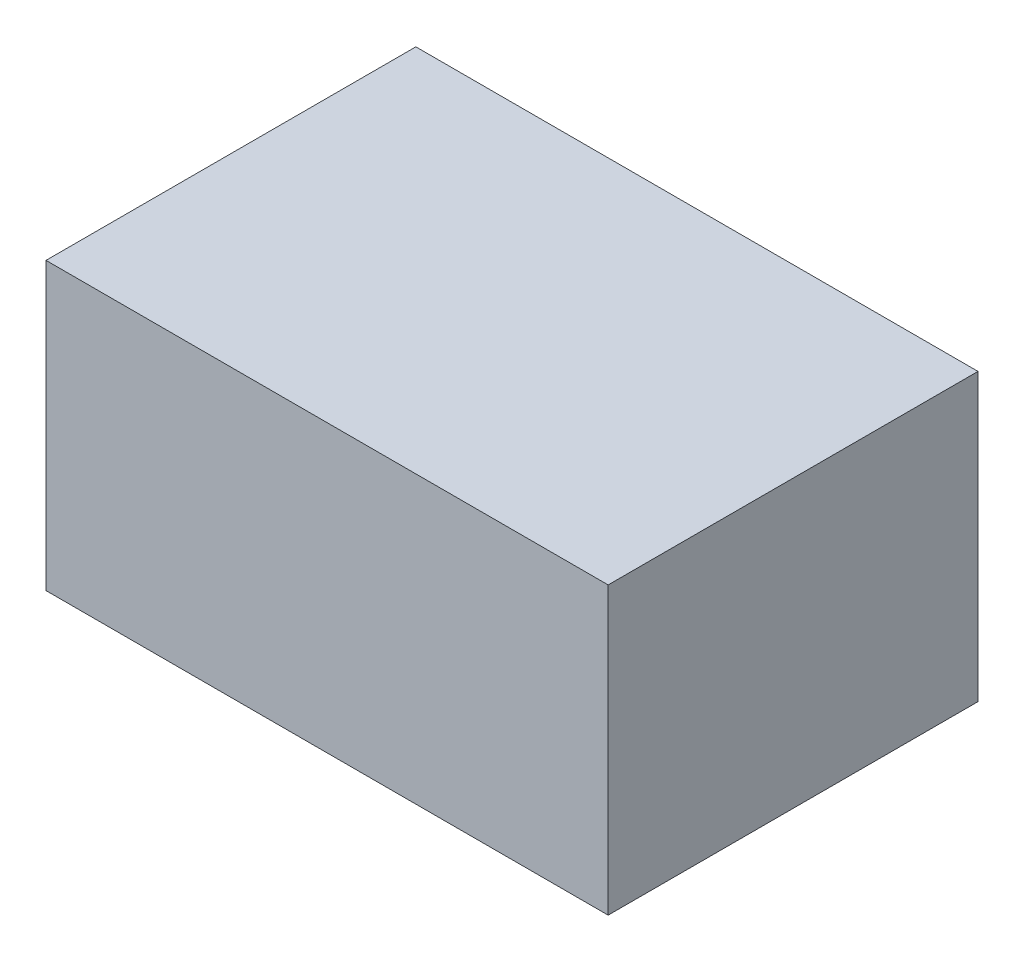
ISO-10303-21;
HEADER;
FILE_DESCRIPTION(('STEP AP214'),'2;1');
FILE_NAME('part.step','',(''),(''),'','','');
FILE_SCHEMA(('AUTOMOTIVE_DESIGN { 1 0 10303 214 1 1 1 1 }'));
ENDSEC;
DATA;
#1=APPLICATION_CONTEXT('core data for automotive mechanical design processes');
#2=APPLICATION_PROTOCOL_DEFINITION('international standard','automotive_design',2000,#1);
#3=PRODUCT_CONTEXT('',#1,'mechanical');
#4=PRODUCT('Part','Part','',(#3));
#5=PRODUCT_RELATED_PRODUCT_CATEGORY('part','',(#4));
#6=PRODUCT_DEFINITION_FORMATION('','',#4);
#7=PRODUCT_DEFINITION_CONTEXT('part definition',#1,'design');
#8=PRODUCT_DEFINITION('design','',#6,#7);
#9=PRODUCT_DEFINITION_SHAPE('','',#8);
#10=(LENGTH_UNIT() NAMED_UNIT(*) SI_UNIT(.MILLI.,.METRE.));
#11=(NAMED_UNIT(*) PLANE_ANGLE_UNIT() SI_UNIT($,.RADIAN.));
#12=(NAMED_UNIT(*) SI_UNIT($,.STERADIAN.) SOLID_ANGLE_UNIT());
#13=UNCERTAINTY_MEASURE_WITH_UNIT(LENGTH_MEASURE(1.E-05),#10,'distance_accuracy_value','');
#14=(GEOMETRIC_REPRESENTATION_CONTEXT(3) GLOBAL_UNCERTAINTY_ASSIGNED_CONTEXT((#13)) GLOBAL_UNIT_ASSIGNED_CONTEXT((#10,
#11,#12)) REPRESENTATION_CONTEXT('',''));
#15=CARTESIAN_POINT('',(0.,0.,0.));
#16=DIRECTION('',(0.,0.,1.));
#17=DIRECTION('',(1.,0.,0.));
#18=AXIS2_PLACEMENT_3D('',#15,#16,#17);
#19=CARTESIAN_POINT('',(0.,58.,0.));
#20=DIRECTION('',(1.,0.,0.));
#21=DIRECTION('',(0.,0.,-1.));
#22=AXIS2_PLACEMENT_3D('',#19,#20,#21);
#23=PLANE('',#22);
#24=DIRECTION('',(0.,0.,1.));
#25=VECTOR('',#24,1.);
#26=CARTESIAN_POINT('',(0.,0.,0.));
#27=LINE('',#26,#25);
#28=CARTESIAN_POINT('',(0.,0.,-75.));
#29=VERTEX_POINT('',#28);
#30=CARTESIAN_POINT('',(0.,0.,0.));
#31=VERTEX_POINT('',#30);
#32=EDGE_CURVE('E107',#29,#31,#27,.T.);
#33=ORIENTED_EDGE('',*,*,#32,.T.);
#34=DIRECTION('',(0.,-1.,0.));
#35=VECTOR('',#34,1.);
#36=CARTESIAN_POINT('',(0.,58.,0.));
#37=LINE('',#36,#35);
#38=CARTESIAN_POINT('',(0.,58.,0.));
#39=VERTEX_POINT('',#38);
#40=EDGE_CURVE('E11',#39,#31,#37,.T.);
#41=ORIENTED_EDGE('',*,*,#40,.F.);
#42=DIRECTION('',(0.,0.,1.));
#43=VECTOR('',#42,1.);
#44=CARTESIAN_POINT('',(0.,58.,0.));
#45=LINE('',#44,#43);
#46=CARTESIAN_POINT('',(0.,58.,-75.));
#47=VERTEX_POINT('',#46);
#48=EDGE_CURVE('E91',#47,#39,#45,.T.);
#49=ORIENTED_EDGE('',*,*,#48,.F.);
#50=DIRECTION('',(0.,-1.,0.));
#51=VECTOR('',#50,1.);
#52=CARTESIAN_POINT('',(0.,58.,-75.));
#53=LINE('',#52,#51);
#54=EDGE_CURVE('E103',#47,#29,#53,.T.);
#55=ORIENTED_EDGE('',*,*,#54,.T.);
#56=EDGE_LOOP('',(#33,#41,#49,#55));
#57=FACE_BOUND('',#56,.T.);
#58=ADVANCED_FACE('F39',(#57),#23,.F.);
#59=CARTESIAN_POINT('',(0.,58.,0.));
#60=DIRECTION('',(0.,0.,-1.));
#61=DIRECTION('',(-1.,0.,0.));
#62=AXIS2_PLACEMENT_3D('',#59,#60,#61);
#63=PLANE('',#62);
#64=DIRECTION('',(1.,0.,0.));
#65=VECTOR('',#64,1.);
#66=CARTESIAN_POINT('',(0.,0.,0.));
#67=LINE('',#66,#65);
#68=CARTESIAN_POINT('',(114.,0.,0.));
#69=VERTEX_POINT('',#68);
#70=EDGE_CURVE('E96',#31,#69,#67,.T.);
#71=ORIENTED_EDGE('',*,*,#70,.T.);
#72=DIRECTION('',(0.,-1.,0.));
#73=VECTOR('',#72,1.);
#74=CARTESIAN_POINT('',(114.,58.,0.));
#75=LINE('',#74,#73);
#76=CARTESIAN_POINT('',(114.,58.,0.));
#77=VERTEX_POINT('',#76);
#78=EDGE_CURVE('E48',#77,#69,#75,.T.);
#79=ORIENTED_EDGE('',*,*,#78,.F.);
#80=DIRECTION('',(1.,0.,0.));
#81=VECTOR('',#80,1.);
#82=CARTESIAN_POINT('',(0.,58.,0.));
#83=LINE('',#82,#81);
#84=EDGE_CURVE('E86',#39,#77,#83,.T.);
#85=ORIENTED_EDGE('',*,*,#84,.F.);
#86=ORIENTED_EDGE('',*,*,#40,.T.);
#87=EDGE_LOOP('',(#71,#79,#85,#86));
#88=FACE_BOUND('',#87,.T.);
#89=ADVANCED_FACE('F95',(#88),#63,.F.);
#90=CARTESIAN_POINT('',(114.,58.,0.));
#91=DIRECTION('',(-1.,0.,0.));
#92=DIRECTION('',(0.,0.,1.));
#93=AXIS2_PLACEMENT_3D('',#90,#91,#92);
#94=PLANE('',#93);
#95=DIRECTION('',(0.,0.,-1.));
#96=VECTOR('',#95,1.);
#97=CARTESIAN_POINT('',(114.,0.,0.));
#98=LINE('',#97,#96);
#99=CARTESIAN_POINT('',(114.,0.,-75.));
#100=VERTEX_POINT('',#99);
#101=EDGE_CURVE('E73',#69,#100,#98,.T.);
#102=ORIENTED_EDGE('',*,*,#101,.T.);
#103=DIRECTION('',(0.,-1.,0.));
#104=VECTOR('',#103,1.);
#105=CARTESIAN_POINT('',(114.,58.,-75.));
#106=LINE('',#105,#104);
#107=CARTESIAN_POINT('',(114.,58.,-75.));
#108=VERTEX_POINT('',#107);
#109=EDGE_CURVE('E98',#108,#100,#106,.T.);
#110=ORIENTED_EDGE('',*,*,#109,.F.);
#111=DIRECTION('',(0.,0.,-1.));
#112=VECTOR('',#111,1.);
#113=CARTESIAN_POINT('',(114.,58.,0.));
#114=LINE('',#113,#112);
#115=EDGE_CURVE('E89',#77,#108,#114,.T.);
#116=ORIENTED_EDGE('',*,*,#115,.F.);
#117=ORIENTED_EDGE('',*,*,#78,.T.);
#118=EDGE_LOOP('',(#102,#110,#116,#117));
#119=FACE_BOUND('',#118,.T.);
#120=ADVANCED_FACE('F99',(#119),#94,.F.);
#121=CARTESIAN_POINT('',(0.,58.,-75.));
#122=DIRECTION('',(0.,0.,1.));
#123=DIRECTION('',(1.,0.,0.));
#124=AXIS2_PLACEMENT_3D('',#121,#122,#123);
#125=PLANE('',#124);
#126=DIRECTION('',(-1.,0.,0.));
#127=VECTOR('',#126,1.);
#128=CARTESIAN_POINT('',(0.,0.,-75.));
#129=LINE('',#128,#127);
#130=EDGE_CURVE('E79',#100,#29,#129,.T.);
#131=ORIENTED_EDGE('',*,*,#130,.T.);
#132=ORIENTED_EDGE('',*,*,#54,.F.);
#133=DIRECTION('',(-1.,0.,0.));
#134=VECTOR('',#133,1.);
#135=CARTESIAN_POINT('',(0.,58.,-75.));
#136=LINE('',#135,#134);
#137=EDGE_CURVE('E56',#108,#47,#136,.T.);
#138=ORIENTED_EDGE('',*,*,#137,.F.);
#139=ORIENTED_EDGE('',*,*,#109,.T.);
#140=EDGE_LOOP('',(#131,#132,#138,#139));
#141=FACE_BOUND('',#140,.T.);
#142=ADVANCED_FACE('F120',(#141),#125,.F.);
#143=CARTESIAN_POINT('',(0.,58.,0.));
#144=DIRECTION('',(0.,-1.,0.));
#145=DIRECTION('',(0.,0.,-1.));
#146=AXIS2_PLACEMENT_3D('',#143,#144,#145);
#147=PLANE('',#146);
#148=ORIENTED_EDGE('',*,*,#48,.T.);
#149=ORIENTED_EDGE('',*,*,#84,.T.);
#150=ORIENTED_EDGE('',*,*,#115,.T.);
#151=ORIENTED_EDGE('',*,*,#137,.T.);
#152=EDGE_LOOP('',(#148,#149,#150,#151));
#153=FACE_BOUND('',#152,.T.);
#154=ADVANCED_FACE('F87',(#153),#147,.F.);
#155=CARTESIAN_POINT('',(0.,0.,0.));
#156=DIRECTION('',(0.,-1.,0.));
#157=DIRECTION('',(0.,0.,-1.));
#158=AXIS2_PLACEMENT_3D('',#155,#156,#157);
#159=PLANE('',#158);
#160=ORIENTED_EDGE('',*,*,#32,.F.);
#161=ORIENTED_EDGE('',*,*,#130,.F.);
#162=ORIENTED_EDGE('',*,*,#101,.F.);
#163=ORIENTED_EDGE('',*,*,#70,.F.);
#164=EDGE_LOOP('',(#160,#161,#162,#163));
#165=FACE_BOUND('',#164,.T.);
#166=ADVANCED_FACE('F123',(#165),#159,.T.);
#167=CLOSED_SHELL('',(#58,#89,#120,#142,#154,#166));
#168=MANIFOLD_SOLID_BREP('B2',#167);
#169=ADVANCED_BREP_SHAPE_REPRESENTATION('',(#18,#168),#14);
#170=SHAPE_DEFINITION_REPRESENTATION(#9,#169);
ENDSEC;
END-ISO-10303-21;
